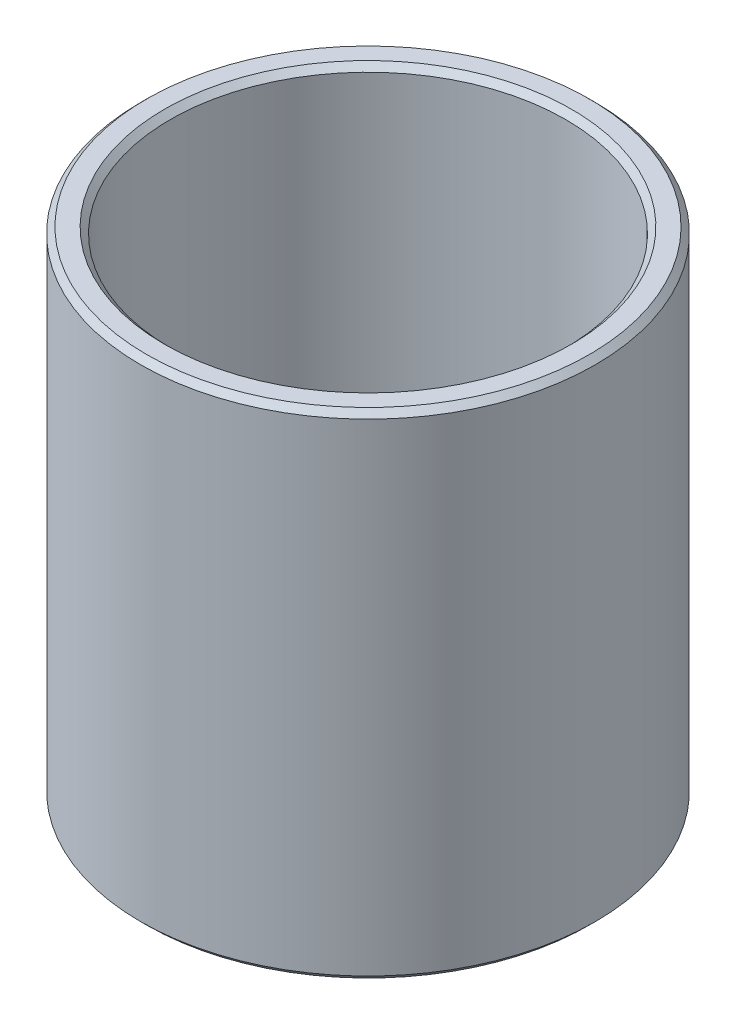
ISO-10303-21;
HEADER;
FILE_DESCRIPTION(('STEP AP214'),'2;1');
FILE_NAME('part.step','',(''),(''),'','','');
FILE_SCHEMA(('AUTOMOTIVE_DESIGN { 1 0 10303 214 1 1 1 1 }'));
ENDSEC;
DATA;
#1=APPLICATION_CONTEXT('core data for automotive mechanical design processes');
#2=APPLICATION_PROTOCOL_DEFINITION('international standard','automotive_design',2000,#1);
#3=PRODUCT_CONTEXT('',#1,'mechanical');
#4=PRODUCT('Part','Part','',(#3));
#5=PRODUCT_RELATED_PRODUCT_CATEGORY('part','',(#4));
#6=PRODUCT_DEFINITION_FORMATION('','',#4);
#7=PRODUCT_DEFINITION_CONTEXT('part definition',#1,'design');
#8=PRODUCT_DEFINITION('design','',#6,#7);
#9=PRODUCT_DEFINITION_SHAPE('','',#8);
#10=(LENGTH_UNIT() NAMED_UNIT(*) SI_UNIT(.MILLI.,.METRE.));
#11=(NAMED_UNIT(*) PLANE_ANGLE_UNIT() SI_UNIT($,.RADIAN.));
#12=(NAMED_UNIT(*) SI_UNIT($,.STERADIAN.) SOLID_ANGLE_UNIT());
#13=UNCERTAINTY_MEASURE_WITH_UNIT(LENGTH_MEASURE(1.E-05),#10,'distance_accuracy_value','');
#14=(GEOMETRIC_REPRESENTATION_CONTEXT(3) GLOBAL_UNCERTAINTY_ASSIGNED_CONTEXT((#13)) GLOBAL_UNIT_ASSIGNED_CONTEXT((#10,
#11,#12)) REPRESENTATION_CONTEXT('',''));
#15=CARTESIAN_POINT('',(0.,0.,0.));
#16=DIRECTION('',(0.,0.,1.));
#17=DIRECTION('',(1.,0.,0.));
#18=AXIS2_PLACEMENT_3D('',#15,#16,#17);
#19=CARTESIAN_POINT('',(0.,25.,0.));
#20=DIRECTION('',(0.,1.,0.));
#21=DIRECTION('',(0.,0.,1.));
#22=AXIS2_PLACEMENT_3D('',#19,#20,#21);
#23=PLANE('',#22);
#24=CARTESIAN_POINT('',(0.,25.,0.));
#25=DIRECTION('',(0.,1.,0.));
#26=DIRECTION('',(0.,0.,1.));
#27=AXIS2_PLACEMENT_3D('',#24,#25,#26);
#28=CIRCLE('',#27,11.2);
#29=CARTESIAN_POINT('',(0.,25.,11.2));
#30=VERTEX_POINT('',#29);
#31=EDGE_CURVE('E10',#30,#30,#28,.T.);
#32=ORIENTED_EDGE('',*,*,#31,.T.);
#33=EDGE_LOOP('',(#32));
#34=FACE_BOUND('',#33,.T.);
#35=CARTESIAN_POINT('',(0.,25.,0.));
#36=DIRECTION('',(0.,1.,0.));
#37=DIRECTION('',(0.,0.,1.));
#38=AXIS2_PLACEMENT_3D('',#35,#36,#37);
#39=CIRCLE('',#38,10.3);
#40=CARTESIAN_POINT('',(0.,25.,10.3));
#41=VERTEX_POINT('',#40);
#42=EDGE_CURVE('E47',#41,#41,#39,.F.);
#43=ORIENTED_EDGE('',*,*,#42,.T.);
#44=EDGE_LOOP('',(#43));
#45=FACE_BOUND('',#44,.T.);
#46=ADVANCED_FACE('F39',(#34,#45),#23,.T.);
#47=CARTESIAN_POINT('',(0.,0.,0.));
#48=DIRECTION('',(0.,1.,0.));
#49=DIRECTION('',(0.,0.,1.));
#50=AXIS2_PLACEMENT_3D('',#47,#48,#49);
#51=PLANE('',#50);
#52=CARTESIAN_POINT('',(0.,0.,0.));
#53=DIRECTION('',(0.,1.,0.));
#54=DIRECTION('',(0.,0.,1.));
#55=AXIS2_PLACEMENT_3D('',#52,#53,#54);
#56=CIRCLE('',#55,10.3);
#57=CARTESIAN_POINT('',(0.,0.,-10.3));
#58=VERTEX_POINT('',#57);
#59=EDGE_CURVE('E66',#58,#58,#56,.T.);
#60=ORIENTED_EDGE('',*,*,#59,.T.);
#61=EDGE_LOOP('',(#60));
#62=FACE_BOUND('',#61,.T.);
#63=CARTESIAN_POINT('',(0.,0.,0.));
#64=DIRECTION('',(0.,1.,0.));
#65=DIRECTION('',(0.,0.,1.));
#66=AXIS2_PLACEMENT_3D('',#63,#64,#65);
#67=CIRCLE('',#66,11.2);
#68=CARTESIAN_POINT('',(0.,0.,11.2));
#69=VERTEX_POINT('',#68);
#70=EDGE_CURVE('E69',#69,#69,#67,.F.);
#71=ORIENTED_EDGE('',*,*,#70,.T.);
#72=EDGE_LOOP('',(#71));
#73=FACE_BOUND('',#72,.T.);
#74=ADVANCED_FACE('F73',(#62,#73),#51,.F.);
#75=CARTESIAN_POINT('',(0.,25.,0.));
#76=DIRECTION('',(0.,-1.,0.));
#77=DIRECTION('',(0.,0.,-1.));
#78=AXIS2_PLACEMENT_3D('',#75,#76,#77);
#79=CYLINDRICAL_SURFACE('',#78,11.5);
#80=CARTESIAN_POINT('',(0.,0.300000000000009,0.));
#81=DIRECTION('',(0.,1.,0.));
#82=DIRECTION('',(0.,0.,1.));
#83=AXIS2_PLACEMENT_3D('',#80,#81,#82);
#84=CIRCLE('',#83,11.5);
#85=CARTESIAN_POINT('',(0.,0.300000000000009,11.5));
#86=VERTEX_POINT('',#85);
#87=EDGE_CURVE('E51',#86,#86,#84,.T.);
#88=ORIENTED_EDGE('',*,*,#87,.T.);
#89=EDGE_LOOP('',(#88));
#90=FACE_BOUND('',#89,.T.);
#91=CARTESIAN_POINT('',(0.,24.7,0.));
#92=DIRECTION('',(0.,1.,0.));
#93=DIRECTION('',(0.,0.,1.));
#94=AXIS2_PLACEMENT_3D('',#91,#92,#93);
#95=CIRCLE('',#94,11.5);
#96=CARTESIAN_POINT('',(0.,24.7,11.5));
#97=VERTEX_POINT('',#96);
#98=EDGE_CURVE('E55',#97,#97,#95,.F.);
#99=ORIENTED_EDGE('',*,*,#98,.T.);
#100=EDGE_LOOP('',(#99));
#101=FACE_BOUND('',#100,.T.);
#102=ADVANCED_FACE('F83',(#90,#101),#79,.T.);
#103=CARTESIAN_POINT('',(0.,25.,0.));
#104=DIRECTION('',(0.,-1.,0.));
#105=DIRECTION('',(0.,0.,-1.));
#106=AXIS2_PLACEMENT_3D('',#103,#104,#105);
#107=CYLINDRICAL_SURFACE('',#106,10.);
#108=CARTESIAN_POINT('',(0.,0.300000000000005,0.));
#109=DIRECTION('',(0.,1.,0.));
#110=DIRECTION('',(0.,0.,1.));
#111=AXIS2_PLACEMENT_3D('',#108,#109,#110);
#112=CIRCLE('',#111,10.);
#113=CARTESIAN_POINT('',(0.,0.300000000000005,-10.));
#114=VERTEX_POINT('',#113);
#115=EDGE_CURVE('E60',#114,#114,#112,.F.);
#116=ORIENTED_EDGE('',*,*,#115,.T.);
#117=EDGE_LOOP('',(#116));
#118=FACE_BOUND('',#117,.T.);
#119=CARTESIAN_POINT('',(0.,24.7,0.));
#120=DIRECTION('',(0.,1.,0.));
#121=DIRECTION('',(0.,0.,1.));
#122=AXIS2_PLACEMENT_3D('',#119,#120,#121);
#123=CIRCLE('',#122,10.);
#124=CARTESIAN_POINT('',(0.,24.7,10.));
#125=VERTEX_POINT('',#124);
#126=EDGE_CURVE('E63',#125,#125,#123,.T.);
#127=ORIENTED_EDGE('',*,*,#126,.T.);
#128=EDGE_LOOP('',(#127));
#129=FACE_BOUND('',#128,.T.);
#130=ADVANCED_FACE('F86',(#118,#129),#107,.F.);
#131=CARTESIAN_POINT('',(0.,0.,0.));
#132=DIRECTION('',(0.,-1.,0.));
#133=DIRECTION('',(0.,0.,-1.));
#134=AXIS2_PLACEMENT_3D('',#131,#132,#133);
#135=CONICAL_SURFACE('',#134,10.3,0.785398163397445);
#136=CARTESIAN_POINT('',(0.,0.300000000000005,-10.));
#137=CARTESIAN_POINT('',(0.,0.296875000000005,-10.003125));
#138=CARTESIAN_POINT('',(0.,0.293750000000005,-10.00625));
#139=CARTESIAN_POINT('',(0.,0.287500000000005,-10.0125));
#140=CARTESIAN_POINT('',(0.,0.284375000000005,-10.015625));
#141=CARTESIAN_POINT('',(0.,0.278125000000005,-10.021875));
#142=CARTESIAN_POINT('',(0.,0.275000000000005,-10.025));
#143=CARTESIAN_POINT('',(0.,0.268750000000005,-10.03125));
#144=CARTESIAN_POINT('',(0.,0.265625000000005,-10.034375));
#145=CARTESIAN_POINT('',(0.,0.259375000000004,-10.040625));
#146=CARTESIAN_POINT('',(0.,0.256250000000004,-10.04375));
#147=CARTESIAN_POINT('',(0.,0.250000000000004,-10.05));
#148=CARTESIAN_POINT('',(0.,0.246875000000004,-10.053125));
#149=CARTESIAN_POINT('',(0.,0.240625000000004,-10.059375));
#150=CARTESIAN_POINT('',(0.,0.237500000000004,-10.0625));
#151=CARTESIAN_POINT('',(0.,0.231250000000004,-10.06875));
#152=CARTESIAN_POINT('',(0.,0.228125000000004,-10.071875));
#153=CARTESIAN_POINT('',(0.,0.221875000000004,-10.078125));
#154=CARTESIAN_POINT('',(0.,0.218750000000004,-10.08125));
#155=CARTESIAN_POINT('',(0.,0.212500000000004,-10.0875));
#156=CARTESIAN_POINT('',(0.,0.209375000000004,-10.090625));
#157=CARTESIAN_POINT('',(0.,0.203125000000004,-10.096875));
#158=CARTESIAN_POINT('',(0.,0.200000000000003,-10.1));
#159=CARTESIAN_POINT('',(0.,0.193750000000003,-10.10625));
#160=CARTESIAN_POINT('',(0.,0.190625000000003,-10.109375));
#161=CARTESIAN_POINT('',(0.,0.184375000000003,-10.115625));
#162=CARTESIAN_POINT('',(0.,0.181250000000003,-10.11875));
#163=CARTESIAN_POINT('',(0.,0.175000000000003,-10.125));
#164=CARTESIAN_POINT('',(0.,0.171875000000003,-10.128125));
#165=CARTESIAN_POINT('',(0.,0.165625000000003,-10.134375));
#166=CARTESIAN_POINT('',(0.,0.162500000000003,-10.1375));
#167=CARTESIAN_POINT('',(0.,0.156250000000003,-10.14375));
#168=CARTESIAN_POINT('',(0.,0.153125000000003,-10.146875));
#169=CARTESIAN_POINT('',(0.,0.146875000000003,-10.153125));
#170=CARTESIAN_POINT('',(0.,0.143750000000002,-10.15625));
#171=CARTESIAN_POINT('',(0.,0.137500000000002,-10.1625));
#172=CARTESIAN_POINT('',(0.,0.134375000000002,-10.165625));
#173=CARTESIAN_POINT('',(0.,0.128125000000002,-10.171875));
#174=CARTESIAN_POINT('',(0.,0.125000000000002,-10.175));
#175=CARTESIAN_POINT('',(0.,0.118750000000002,-10.18125));
#176=CARTESIAN_POINT('',(0.,0.115625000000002,-10.184375));
#177=CARTESIAN_POINT('',(0.,0.109375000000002,-10.190625));
#178=CARTESIAN_POINT('',(0.,0.106250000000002,-10.19375));
#179=CARTESIAN_POINT('',(0.,0.100000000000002,-10.2));
#180=CARTESIAN_POINT('',(0.,0.0968750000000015,-10.203125));
#181=CARTESIAN_POINT('',(0.,0.0906250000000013,-10.209375));
#182=CARTESIAN_POINT('',(0.,0.0875000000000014,-10.2125));
#183=CARTESIAN_POINT('',(0.,0.0812500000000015,-10.21875));
#184=CARTESIAN_POINT('',(0.,0.0781250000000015,-10.221875));
#185=CARTESIAN_POINT('',(0.,0.0718750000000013,-10.228125));
#186=CARTESIAN_POINT('',(0.,0.0687500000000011,-10.23125));
#187=CARTESIAN_POINT('',(0.,0.0625000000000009,-10.2375));
#188=CARTESIAN_POINT('',(0.,0.0593750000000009,-10.240625));
#189=CARTESIAN_POINT('',(0.,0.053125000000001,-10.246875));
#190=CARTESIAN_POINT('',(0.,0.050000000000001,-10.25));
#191=CARTESIAN_POINT('',(0.,0.0437500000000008,-10.25625));
#192=CARTESIAN_POINT('',(0.,0.0406250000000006,-10.259375));
#193=CARTESIAN_POINT('',(0.,0.0343750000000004,-10.265625));
#194=CARTESIAN_POINT('',(0.,0.0312500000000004,-10.26875));
#195=CARTESIAN_POINT('',(0.,0.0250000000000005,-10.275));
#196=CARTESIAN_POINT('',(0.,0.0218750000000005,-10.278125));
#197=CARTESIAN_POINT('',(0.,0.0156250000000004,-10.284375));
#198=CARTESIAN_POINT('',(0.,0.0125000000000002,-10.2875));
#199=CARTESIAN_POINT('',(0.,0.00624999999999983,-10.29375));
#200=CARTESIAN_POINT('',(0.,0.00312499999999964,-10.296875));
#201=CARTESIAN_POINT('',(0.,0.,-10.3));
#202=B_SPLINE_CURVE_WITH_KNOTS('',3,(#136,#137,#138,#139,#140,#141,#142,#143,#144,#145,#146,
#147,#148,#149,#150,#151,#152,#153,#154,#155,#156,#157,#158,#159,#160,#161,#162,#163,#164,#165,
#166,#167,#168,#169,#170,#171,#172,#173,#174,#175,#176,#177,#178,#179,#180,#181,#182,#183,#184,
#185,#186,#187,#188,#189,#190,#191,#192,#193,#194,#195,#196,#197,#198,#199,#200,#201),
.UNSPECIFIED.,.F.,.F.,(4,2,2,2,2,2,2,2,2,2,2,2,2,2,2,2,2,2,2,2,2,2,2,2,2,2,2,2,2,2,2,2,4),(0.,
0.0132582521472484,0.0265165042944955,0.0397747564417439,0.0530330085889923,0.0662912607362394,
0.0795495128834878,0.0928077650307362,0.106066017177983,0.119324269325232,0.13258252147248,
0.145840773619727,0.159099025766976,0.172357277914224,0.185615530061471,0.19887378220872,
0.212132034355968,0.225390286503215,0.238648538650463,0.251906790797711,0.265165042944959,
0.278423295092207,0.291681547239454,0.304939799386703,0.318198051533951,0.331456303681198,
0.344714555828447,0.357972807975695,0.371231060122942,0.384489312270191,0.397747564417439,
0.411005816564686,0.424264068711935),.UNSPECIFIED.);
#203=EDGE_CURVE('BSEAM79',#114,#58,#202,.T.);
#204=ORIENTED_EDGE('',*,*,#115,.F.);
#205=ORIENTED_EDGE('',*,*,#59,.F.);
#206=ORIENTED_EDGE('',*,*,#203,.T.);
#207=ORIENTED_EDGE('',*,*,#203,.F.);
#208=EDGE_LOOP('',(#204,#206,#205,#207));
#209=FACE_BOUND('',#208,.T.);
#210=ADVANCED_FACE('F79',(#209),#135,.F.);
#211=CARTESIAN_POINT('',(0.,0.300000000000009,0.));
#212=DIRECTION('',(0.,1.,0.));
#213=DIRECTION('',(0.,0.,1.));
#214=AXIS2_PLACEMENT_3D('',#211,#212,#213);
#215=CONICAL_SURFACE('',#214,11.5,0.785398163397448);
#216=ORIENTED_EDGE('',*,*,#70,.F.);
#217=EDGE_LOOP('',(#216));
#218=FACE_BOUND('',#217,.T.);
#219=ORIENTED_EDGE('',*,*,#87,.F.);
#220=EDGE_LOOP('',(#219));
#221=FACE_BOUND('',#220,.T.);
#222=ADVANCED_FACE('F75',(#218,#221),#215,.T.);
#223=CARTESIAN_POINT('',(0.,25.,0.));
#224=DIRECTION('',(0.,-1.,0.));
#225=DIRECTION('',(0.,0.,-1.));
#226=AXIS2_PLACEMENT_3D('',#223,#224,#225);
#227=CONICAL_SURFACE('',#226,11.2,0.785398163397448);
#228=ORIENTED_EDGE('',*,*,#98,.F.);
#229=EDGE_LOOP('',(#228));
#230=FACE_BOUND('',#229,.T.);
#231=ORIENTED_EDGE('',*,*,#31,.F.);
#232=EDGE_LOOP('',(#231));
#233=FACE_BOUND('',#232,.T.);
#234=ADVANCED_FACE('F78',(#230,#233),#227,.T.);
#235=CARTESIAN_POINT('',(0.,24.7,0.));
#236=DIRECTION('',(0.,1.,0.));
#237=DIRECTION('',(0.,0.,1.));
#238=AXIS2_PLACEMENT_3D('',#235,#236,#237);
#239=CONICAL_SURFACE('',#238,10.,0.785398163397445);
#240=ORIENTED_EDGE('',*,*,#42,.F.);
#241=EDGE_LOOP('',(#240));
#242=FACE_BOUND('',#241,.T.);
#243=ORIENTED_EDGE('',*,*,#126,.F.);
#244=EDGE_LOOP('',(#243));
#245=FACE_BOUND('',#244,.T.);
#246=ADVANCED_FACE('F42',(#242,#245),#239,.F.);
#247=CLOSED_SHELL('',(#46,#74,#102,#130,#210,#222,#234,#246));
#248=MANIFOLD_SOLID_BREP('B2',#247);
#249=ADVANCED_BREP_SHAPE_REPRESENTATION('',(#18,#248),#14);
#250=SHAPE_DEFINITION_REPRESENTATION(#9,#249);
ENDSEC;
END-ISO-10303-21;
